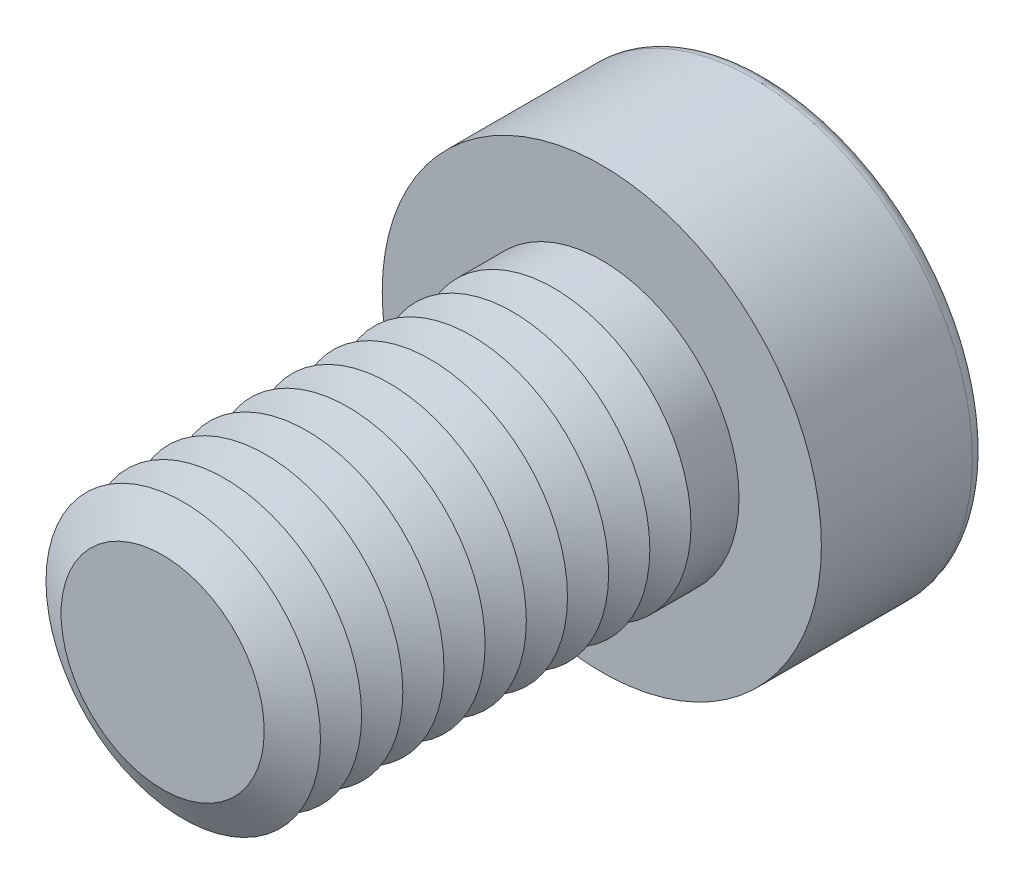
ISO-10303-21;
HEADER;
FILE_DESCRIPTION(('STEP AP214'),'2;1');
FILE_NAME('part.step','',(''),(''),'','','');
FILE_SCHEMA(('AUTOMOTIVE_DESIGN { 1 0 10303 214 1 1 1 1 }'));
ENDSEC;
DATA;
#1=APPLICATION_CONTEXT('core data for automotive mechanical design processes');
#2=APPLICATION_PROTOCOL_DEFINITION('international standard','automotive_design',2000,#1);
#3=PRODUCT_CONTEXT('',#1,'mechanical');
#4=PRODUCT('Part','Part','',(#3));
#5=PRODUCT_RELATED_PRODUCT_CATEGORY('part','',(#4));
#6=PRODUCT_DEFINITION_FORMATION('','',#4);
#7=PRODUCT_DEFINITION_CONTEXT('part definition',#1,'design');
#8=PRODUCT_DEFINITION('design','',#6,#7);
#9=PRODUCT_DEFINITION_SHAPE('','',#8);
#10=(LENGTH_UNIT() NAMED_UNIT(*) SI_UNIT(.MILLI.,.METRE.));
#11=(NAMED_UNIT(*) PLANE_ANGLE_UNIT() SI_UNIT($,.RADIAN.));
#12=(NAMED_UNIT(*) SI_UNIT($,.STERADIAN.) SOLID_ANGLE_UNIT());
#13=UNCERTAINTY_MEASURE_WITH_UNIT(LENGTH_MEASURE(1.E-05),#10,'distance_accuracy_value','');
#14=(GEOMETRIC_REPRESENTATION_CONTEXT(3) GLOBAL_UNCERTAINTY_ASSIGNED_CONTEXT((#13)) GLOBAL_UNIT_ASSIGNED_CONTEXT((#10,
#11,#12)) REPRESENTATION_CONTEXT('',''));
#15=CARTESIAN_POINT('',(0.,0.,0.));
#16=DIRECTION('',(0.,0.,1.));
#17=DIRECTION('',(1.,0.,0.));
#18=AXIS2_PLACEMENT_3D('',#15,#16,#17);
#19=CARTESIAN_POINT('',(0.,0.,10.75));
#20=DIRECTION('',(0.,0.,1.));
#21=DIRECTION('',(1.,0.,0.));
#22=AXIS2_PLACEMENT_3D('',#19,#20,#21);
#23=CONICAL_SURFACE('',#22,5.,1.0471975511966);
#24=CARTESIAN_POINT('',(0.,0.,10.));
#25=DIRECTION('',(0.,0.,1.));
#26=DIRECTION('',(1.,0.,0.));
#27=AXIS2_PLACEMENT_3D('',#24,#25,#26);
#28=CIRCLE('',#27,3.70096189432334);
#29=CARTESIAN_POINT('',(3.70096189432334,0.,10.));
#30=VERTEX_POINT('',#29);
#31=EDGE_CURVE('E313',#30,#30,#28,.T.);
#32=ORIENTED_EDGE('',*,*,#31,.T.);
#33=EDGE_LOOP('',(#32));
#34=FACE_BOUND('',#33,.T.);
#35=CARTESIAN_POINT('',(0.,0.,10.75));
#36=DIRECTION('',(0.,0.,1.));
#37=DIRECTION('',(1.,0.,0.));
#38=AXIS2_PLACEMENT_3D('',#35,#36,#37);
#39=CIRCLE('',#38,5.);
#40=CARTESIAN_POINT('',(5.,0.,10.75));
#41=VERTEX_POINT('',#40);
#42=EDGE_CURVE('E315',#41,#41,#39,.T.);
#43=ORIENTED_EDGE('',*,*,#42,.F.);
#44=EDGE_LOOP('',(#43));
#45=FACE_BOUND('',#44,.T.);
#46=ADVANCED_FACE('F39',(#34,#45),#23,.T.);
#47=CARTESIAN_POINT('',(0.,0.,10.));
#48=DIRECTION('',(0.,0.,-1.));
#49=DIRECTION('',(-1.,0.,0.));
#50=AXIS2_PLACEMENT_3D('',#47,#48,#49);
#51=CONICAL_SURFACE('',#50,3.70096189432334,1.0471975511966);
#52=CARTESIAN_POINT('',(0.,0.,9.25));
#53=DIRECTION('',(0.,0.,1.));
#54=DIRECTION('',(1.,0.,0.));
#55=AXIS2_PLACEMENT_3D('',#52,#53,#54);
#56=CIRCLE('',#55,5.);
#57=CARTESIAN_POINT('',(5.,0.,9.25));
#58=VERTEX_POINT('',#57);
#59=EDGE_CURVE('E323',#58,#58,#56,.T.);
#60=ORIENTED_EDGE('',*,*,#59,.T.);
#61=EDGE_LOOP('',(#60));
#62=FACE_BOUND('',#61,.T.);
#63=ORIENTED_EDGE('',*,*,#31,.F.);
#64=EDGE_LOOP('',(#63));
#65=FACE_BOUND('',#64,.T.);
#66=ADVANCED_FACE('F245',(#62,#65),#51,.T.);
#67=CARTESIAN_POINT('',(0.,0.,16.));
#68=DIRECTION('',(0.,0.,1.));
#69=DIRECTION('',(1.,0.,0.));
#70=AXIS2_PLACEMENT_3D('',#67,#68,#69);
#71=PLANE('',#70);
#72=CARTESIAN_POINT('',(0.,0.,16.));
#73=DIRECTION('',(0.,0.,1.));
#74=DIRECTION('',(1.,0.,0.));
#75=AXIS2_PLACEMENT_3D('',#72,#73,#74);
#76=CIRCLE('',#75,3.70096189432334);
#77=CARTESIAN_POINT('',(3.70096189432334,0.,16.));
#78=VERTEX_POINT('',#77);
#79=EDGE_CURVE('E174',#78,#78,#76,.T.);
#80=ORIENTED_EDGE('',*,*,#79,.T.);
#81=EDGE_LOOP('',(#80));
#82=FACE_BOUND('',#81,.T.);
#83=ADVANCED_FACE('F251',(#82),#71,.T.);
#84=CARTESIAN_POINT('',(0.,0.,16.));
#85=DIRECTION('',(0.,0.,-1.));
#86=DIRECTION('',(-1.,0.,0.));
#87=AXIS2_PLACEMENT_3D('',#84,#85,#86);
#88=CONICAL_SURFACE('',#87,3.70096189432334,1.0471975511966);
#89=CARTESIAN_POINT('',(0.,0.,15.25));
#90=DIRECTION('',(0.,0.,1.));
#91=DIRECTION('',(1.,0.,0.));
#92=AXIS2_PLACEMENT_3D('',#89,#90,#91);
#93=CIRCLE('',#92,5.);
#94=CARTESIAN_POINT('',(5.,0.,15.25));
#95=VERTEX_POINT('',#94);
#96=EDGE_CURVE('E291',#95,#95,#93,.T.);
#97=ORIENTED_EDGE('',*,*,#96,.T.);
#98=EDGE_LOOP('',(#97));
#99=FACE_BOUND('',#98,.T.);
#100=ORIENTED_EDGE('',*,*,#79,.F.);
#101=EDGE_LOOP('',(#100));
#102=FACE_BOUND('',#101,.T.);
#103=ADVANCED_FACE('F199',(#99,#102),#88,.T.);
#104=CARTESIAN_POINT('',(0.,0.,15.25));
#105=DIRECTION('',(0.,0.,1.));
#106=DIRECTION('',(1.,0.,0.));
#107=AXIS2_PLACEMENT_3D('',#104,#105,#106);
#108=CONICAL_SURFACE('',#107,5.,1.0471975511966);
#109=CARTESIAN_POINT('',(0.,0.,14.5));
#110=DIRECTION('',(0.,0.,1.));
#111=DIRECTION('',(1.,0.,0.));
#112=AXIS2_PLACEMENT_3D('',#109,#110,#111);
#113=CIRCLE('',#112,3.70096189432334);
#114=CARTESIAN_POINT('',(3.70096189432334,0.,14.5));
#115=VERTEX_POINT('',#114);
#116=EDGE_CURVE('E288',#115,#115,#113,.T.);
#117=ORIENTED_EDGE('',*,*,#116,.T.);
#118=EDGE_LOOP('',(#117));
#119=FACE_BOUND('',#118,.T.);
#120=ORIENTED_EDGE('',*,*,#96,.F.);
#121=EDGE_LOOP('',(#120));
#122=FACE_BOUND('',#121,.T.);
#123=ADVANCED_FACE('F277',(#119,#122),#108,.T.);
#124=CARTESIAN_POINT('',(0.,0.,14.5));
#125=DIRECTION('',(0.,0.,-1.));
#126=DIRECTION('',(-1.,0.,0.));
#127=AXIS2_PLACEMENT_3D('',#124,#125,#126);
#128=CONICAL_SURFACE('',#127,3.70096189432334,1.0471975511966);
#129=CARTESIAN_POINT('',(0.,0.,13.75));
#130=DIRECTION('',(0.,0.,1.));
#131=DIRECTION('',(1.,0.,0.));
#132=AXIS2_PLACEMENT_3D('',#129,#130,#131);
#133=CIRCLE('',#132,5.);
#134=CARTESIAN_POINT('',(5.,0.,13.75));
#135=VERTEX_POINT('',#134);
#136=EDGE_CURVE('E300',#135,#135,#133,.T.);
#137=ORIENTED_EDGE('',*,*,#136,.T.);
#138=EDGE_LOOP('',(#137));
#139=FACE_BOUND('',#138,.T.);
#140=ORIENTED_EDGE('',*,*,#116,.F.);
#141=EDGE_LOOP('',(#140));
#142=FACE_BOUND('',#141,.T.);
#143=ADVANCED_FACE('F274',(#139,#142),#128,.T.);
#144=CARTESIAN_POINT('',(0.,0.,13.75));
#145=DIRECTION('',(0.,0.,1.));
#146=DIRECTION('',(1.,0.,0.));
#147=AXIS2_PLACEMENT_3D('',#144,#145,#146);
#148=CONICAL_SURFACE('',#147,5.,1.0471975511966);
#149=CARTESIAN_POINT('',(0.,0.,13.));
#150=DIRECTION('',(0.,0.,1.));
#151=DIRECTION('',(1.,0.,0.));
#152=AXIS2_PLACEMENT_3D('',#149,#150,#151);
#153=CIRCLE('',#152,3.70096189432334);
#154=CARTESIAN_POINT('',(3.70096189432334,0.,13.));
#155=VERTEX_POINT('',#154);
#156=EDGE_CURVE('E293',#155,#155,#153,.T.);
#157=ORIENTED_EDGE('',*,*,#156,.T.);
#158=EDGE_LOOP('',(#157));
#159=FACE_BOUND('',#158,.T.);
#160=ORIENTED_EDGE('',*,*,#136,.F.);
#161=EDGE_LOOP('',(#160));
#162=FACE_BOUND('',#161,.T.);
#163=ADVANCED_FACE('F270',(#159,#162),#148,.T.);
#164=CARTESIAN_POINT('',(0.,0.,13.));
#165=DIRECTION('',(0.,0.,-1.));
#166=DIRECTION('',(-1.,0.,0.));
#167=AXIS2_PLACEMENT_3D('',#164,#165,#166);
#168=CONICAL_SURFACE('',#167,3.70096189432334,1.0471975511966);
#169=CARTESIAN_POINT('',(0.,0.,12.25));
#170=DIRECTION('',(0.,0.,1.));
#171=DIRECTION('',(1.,0.,0.));
#172=AXIS2_PLACEMENT_3D('',#169,#170,#171);
#173=CIRCLE('',#172,5.);
#174=CARTESIAN_POINT('',(5.,0.,12.25));
#175=VERTEX_POINT('',#174);
#176=EDGE_CURVE('E309',#175,#175,#173,.T.);
#177=ORIENTED_EDGE('',*,*,#176,.T.);
#178=EDGE_LOOP('',(#177));
#179=FACE_BOUND('',#178,.T.);
#180=ORIENTED_EDGE('',*,*,#156,.F.);
#181=EDGE_LOOP('',(#180));
#182=FACE_BOUND('',#181,.T.);
#183=ADVANCED_FACE('F266',(#179,#182),#168,.T.);
#184=CARTESIAN_POINT('',(0.,0.,12.25));
#185=DIRECTION('',(0.,0.,1.));
#186=DIRECTION('',(1.,0.,0.));
#187=AXIS2_PLACEMENT_3D('',#184,#185,#186);
#188=CONICAL_SURFACE('',#187,5.,1.0471975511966);
#189=CARTESIAN_POINT('',(0.,0.,11.5));
#190=DIRECTION('',(0.,0.,1.));
#191=DIRECTION('',(1.,0.,0.));
#192=AXIS2_PLACEMENT_3D('',#189,#190,#191);
#193=CIRCLE('',#192,3.70096189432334);
#194=CARTESIAN_POINT('',(3.70096189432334,0.,11.5));
#195=VERTEX_POINT('',#194);
#196=EDGE_CURVE('E306',#195,#195,#193,.T.);
#197=ORIENTED_EDGE('',*,*,#196,.T.);
#198=EDGE_LOOP('',(#197));
#199=FACE_BOUND('',#198,.T.);
#200=ORIENTED_EDGE('',*,*,#176,.F.);
#201=EDGE_LOOP('',(#200));
#202=FACE_BOUND('',#201,.T.);
#203=ADVANCED_FACE('F262',(#199,#202),#188,.T.);
#204=CARTESIAN_POINT('',(0.,0.,11.5));
#205=DIRECTION('',(0.,0.,-1.));
#206=DIRECTION('',(-1.,0.,0.));
#207=AXIS2_PLACEMENT_3D('',#204,#205,#206);
#208=CONICAL_SURFACE('',#207,3.70096189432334,1.0471975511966);
#209=ORIENTED_EDGE('',*,*,#42,.T.);
#210=EDGE_LOOP('',(#209));
#211=FACE_BOUND('',#210,.T.);
#212=ORIENTED_EDGE('',*,*,#196,.F.);
#213=EDGE_LOOP('',(#212));
#214=FACE_BOUND('',#213,.T.);
#215=ADVANCED_FACE('F258',(#211,#214),#208,.T.);
#216=CARTESIAN_POINT('',(0.,0.,9.25));
#217=DIRECTION('',(0.,0.,1.));
#218=DIRECTION('',(1.,0.,0.));
#219=AXIS2_PLACEMENT_3D('',#216,#217,#218);
#220=CONICAL_SURFACE('',#219,5.,1.0471975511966);
#221=CARTESIAN_POINT('',(0.,0.,8.5));
#222=DIRECTION('',(0.,0.,1.));
#223=DIRECTION('',(1.,0.,0.));
#224=AXIS2_PLACEMENT_3D('',#221,#222,#223);
#225=CIRCLE('',#224,3.70096189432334);
#226=CARTESIAN_POINT('',(3.70096189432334,0.,8.5));
#227=VERTEX_POINT('',#226);
#228=EDGE_CURVE('E319',#227,#227,#225,.T.);
#229=ORIENTED_EDGE('',*,*,#228,.T.);
#230=EDGE_LOOP('',(#229));
#231=FACE_BOUND('',#230,.T.);
#232=ORIENTED_EDGE('',*,*,#59,.F.);
#233=EDGE_LOOP('',(#232));
#234=FACE_BOUND('',#233,.T.);
#235=ADVANCED_FACE('F261',(#231,#234),#220,.T.);
#236=CARTESIAN_POINT('',(0.,0.,8.5));
#237=DIRECTION('',(0.,0.,-1.));
#238=DIRECTION('',(-1.,0.,0.));
#239=AXIS2_PLACEMENT_3D('',#236,#237,#238);
#240=CONICAL_SURFACE('',#239,3.70096189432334,1.0471975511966);
#241=CARTESIAN_POINT('',(0.,0.,7.75));
#242=DIRECTION('',(0.,0.,1.));
#243=DIRECTION('',(1.,0.,0.));
#244=AXIS2_PLACEMENT_3D('',#241,#242,#243);
#245=CIRCLE('',#244,5.);
#246=CARTESIAN_POINT('',(5.,0.,7.75));
#247=VERTEX_POINT('',#246);
#248=EDGE_CURVE('E331',#247,#247,#245,.T.);
#249=ORIENTED_EDGE('',*,*,#248,.T.);
#250=EDGE_LOOP('',(#249));
#251=FACE_BOUND('',#250,.T.);
#252=ORIENTED_EDGE('',*,*,#228,.F.);
#253=EDGE_LOOP('',(#252));
#254=FACE_BOUND('',#253,.T.);
#255=ADVANCED_FACE('F401',(#251,#254),#240,.T.);
#256=CARTESIAN_POINT('',(0.,0.,7.75));
#257=DIRECTION('',(0.,0.,1.));
#258=DIRECTION('',(1.,0.,0.));
#259=AXIS2_PLACEMENT_3D('',#256,#257,#258);
#260=CONICAL_SURFACE('',#259,5.,1.0471975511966);
#261=CARTESIAN_POINT('',(0.,0.,7.));
#262=DIRECTION('',(0.,0.,1.));
#263=DIRECTION('',(1.,0.,0.));
#264=AXIS2_PLACEMENT_3D('',#261,#262,#263);
#265=CIRCLE('',#264,3.70096189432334);
#266=CARTESIAN_POINT('',(3.70096189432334,0.,7.));
#267=VERTEX_POINT('',#266);
#268=EDGE_CURVE('E327',#267,#267,#265,.T.);
#269=ORIENTED_EDGE('',*,*,#268,.T.);
#270=EDGE_LOOP('',(#269));
#271=FACE_BOUND('',#270,.T.);
#272=ORIENTED_EDGE('',*,*,#248,.F.);
#273=EDGE_LOOP('',(#272));
#274=FACE_BOUND('',#273,.T.);
#275=ADVANCED_FACE('F397',(#271,#274),#260,.T.);
#276=CARTESIAN_POINT('',(0.,0.,7.));
#277=DIRECTION('',(0.,0.,-1.));
#278=DIRECTION('',(-1.,0.,0.));
#279=AXIS2_PLACEMENT_3D('',#276,#277,#278);
#280=CONICAL_SURFACE('',#279,3.70096189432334,1.0471975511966);
#281=CARTESIAN_POINT('',(0.,0.,6.25));
#282=DIRECTION('',(0.,0.,1.));
#283=DIRECTION('',(1.,0.,0.));
#284=AXIS2_PLACEMENT_3D('',#281,#282,#283);
#285=CIRCLE('',#284,5.);
#286=CARTESIAN_POINT('',(5.,0.,6.25));
#287=VERTEX_POINT('',#286);
#288=EDGE_CURVE('E339',#287,#287,#285,.T.);
#289=ORIENTED_EDGE('',*,*,#288,.T.);
#290=EDGE_LOOP('',(#289));
#291=FACE_BOUND('',#290,.T.);
#292=ORIENTED_EDGE('',*,*,#268,.F.);
#293=EDGE_LOOP('',(#292));
#294=FACE_BOUND('',#293,.T.);
#295=ADVANCED_FACE('F393',(#291,#294),#280,.T.);
#296=CARTESIAN_POINT('',(0.,0.,6.25));
#297=DIRECTION('',(0.,0.,1.));
#298=DIRECTION('',(1.,0.,0.));
#299=AXIS2_PLACEMENT_3D('',#296,#297,#298);
#300=CONICAL_SURFACE('',#299,5.,1.0471975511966);
#301=CARTESIAN_POINT('',(0.,0.,5.5));
#302=DIRECTION('',(0.,0.,1.));
#303=DIRECTION('',(1.,0.,0.));
#304=AXIS2_PLACEMENT_3D('',#301,#302,#303);
#305=CIRCLE('',#304,3.70096189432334);
#306=CARTESIAN_POINT('',(3.70096189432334,0.,5.5));
#307=VERTEX_POINT('',#306);
#308=EDGE_CURVE('E335',#307,#307,#305,.T.);
#309=ORIENTED_EDGE('',*,*,#308,.T.);
#310=EDGE_LOOP('',(#309));
#311=FACE_BOUND('',#310,.T.);
#312=ORIENTED_EDGE('',*,*,#288,.F.);
#313=EDGE_LOOP('',(#312));
#314=FACE_BOUND('',#313,.T.);
#315=ADVANCED_FACE('F389',(#311,#314),#300,.T.);
#316=CARTESIAN_POINT('',(0.,0.,5.5));
#317=DIRECTION('',(0.,0.,-1.));
#318=DIRECTION('',(-1.,0.,0.));
#319=AXIS2_PLACEMENT_3D('',#316,#317,#318);
#320=CONICAL_SURFACE('',#319,3.70096189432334,1.0471975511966);
#321=CARTESIAN_POINT('',(0.,0.,4.75));
#322=DIRECTION('',(0.,0.,1.));
#323=DIRECTION('',(1.,0.,0.));
#324=AXIS2_PLACEMENT_3D('',#321,#322,#323);
#325=CIRCLE('',#324,5.);
#326=CARTESIAN_POINT('',(5.,0.,4.75));
#327=VERTEX_POINT('',#326);
#328=EDGE_CURVE('E347',#327,#327,#325,.T.);
#329=ORIENTED_EDGE('',*,*,#328,.T.);
#330=EDGE_LOOP('',(#329));
#331=FACE_BOUND('',#330,.T.);
#332=ORIENTED_EDGE('',*,*,#308,.F.);
#333=EDGE_LOOP('',(#332));
#334=FACE_BOUND('',#333,.T.);
#335=ADVANCED_FACE('F385',(#331,#334),#320,.T.);
#336=CARTESIAN_POINT('',(0.,0.,4.75));
#337=DIRECTION('',(0.,0.,1.));
#338=DIRECTION('',(1.,0.,0.));
#339=AXIS2_PLACEMENT_3D('',#336,#337,#338);
#340=CONICAL_SURFACE('',#339,5.,1.0471975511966);
#341=CARTESIAN_POINT('',(0.,0.,4.));
#342=DIRECTION('',(0.,0.,1.));
#343=DIRECTION('',(1.,0.,0.));
#344=AXIS2_PLACEMENT_3D('',#341,#342,#343);
#345=CIRCLE('',#344,3.70096189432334);
#346=CARTESIAN_POINT('',(3.70096189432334,0.,4.));
#347=VERTEX_POINT('',#346);
#348=EDGE_CURVE('E343',#347,#347,#345,.T.);
#349=ORIENTED_EDGE('',*,*,#348,.T.);
#350=EDGE_LOOP('',(#349));
#351=FACE_BOUND('',#350,.T.);
#352=ORIENTED_EDGE('',*,*,#328,.F.);
#353=EDGE_LOOP('',(#352));
#354=FACE_BOUND('',#353,.T.);
#355=ADVANCED_FACE('F380',(#351,#354),#340,.T.);
#356=CARTESIAN_POINT('',(0.,0.,4.));
#357=DIRECTION('',(0.,0.,-1.));
#358=DIRECTION('',(-1.,0.,0.));
#359=AXIS2_PLACEMENT_3D('',#356,#357,#358);
#360=CONICAL_SURFACE('',#359,3.70096189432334,1.0471975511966);
#361=CARTESIAN_POINT('',(0.,0.,3.25));
#362=DIRECTION('',(0.,0.,1.));
#363=DIRECTION('',(1.,0.,0.));
#364=AXIS2_PLACEMENT_3D('',#361,#362,#363);
#365=CIRCLE('',#364,5.);
#366=CARTESIAN_POINT('',(5.,0.,3.25));
#367=VERTEX_POINT('',#366);
#368=EDGE_CURVE('E359',#367,#367,#365,.T.);
#369=ORIENTED_EDGE('',*,*,#368,.T.);
#370=EDGE_LOOP('',(#369));
#371=FACE_BOUND('',#370,.T.);
#372=ORIENTED_EDGE('',*,*,#348,.F.);
#373=EDGE_LOOP('',(#372));
#374=FACE_BOUND('',#373,.T.);
#375=ADVANCED_FACE('F366',(#371,#374),#360,.T.);
#376=CARTESIAN_POINT('',(0.,0.,3.25));
#377=DIRECTION('',(0.,0.,1.));
#378=DIRECTION('',(1.,0.,0.));
#379=AXIS2_PLACEMENT_3D('',#376,#377,#378);
#380=CONICAL_SURFACE('',#379,5.,1.0471975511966);
#381=CARTESIAN_POINT('',(0.,0.,2.5));
#382=DIRECTION('',(0.,0.,1.));
#383=DIRECTION('',(1.,0.,0.));
#384=AXIS2_PLACEMENT_3D('',#381,#382,#383);
#385=CIRCLE('',#384,3.70096189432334);
#386=CARTESIAN_POINT('',(3.70096189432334,0.,2.5));
#387=VERTEX_POINT('',#386);
#388=EDGE_CURVE('E351',#387,#387,#385,.T.);
#389=ORIENTED_EDGE('',*,*,#388,.T.);
#390=EDGE_LOOP('',(#389));
#391=FACE_BOUND('',#390,.T.);
#392=ORIENTED_EDGE('',*,*,#368,.F.);
#393=EDGE_LOOP('',(#392));
#394=FACE_BOUND('',#393,.T.);
#395=ADVANCED_FACE('F369',(#391,#394),#380,.T.);
#396=CARTESIAN_POINT('',(0.,0.,2.5));
#397=DIRECTION('',(0.,0.,-1.));
#398=DIRECTION('',(-1.,0.,0.));
#399=AXIS2_PLACEMENT_3D('',#396,#397,#398);
#400=CONICAL_SURFACE('',#399,3.70096189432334,1.0471975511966);
#401=CARTESIAN_POINT('',(0.,0.,1.75));
#402=DIRECTION('',(0.,0.,1.));
#403=DIRECTION('',(1.,0.,0.));
#404=AXIS2_PLACEMENT_3D('',#401,#402,#403);
#405=CIRCLE('',#404,5.);
#406=CARTESIAN_POINT('',(5.,0.,1.75));
#407=VERTEX_POINT('',#406);
#408=EDGE_CURVE('E355',#407,#407,#405,.T.);
#409=ORIENTED_EDGE('',*,*,#408,.T.);
#410=EDGE_LOOP('',(#409));
#411=FACE_BOUND('',#410,.T.);
#412=ORIENTED_EDGE('',*,*,#388,.F.);
#413=EDGE_LOOP('',(#412));
#414=FACE_BOUND('',#413,.T.);
#415=ADVANCED_FACE('F371',(#411,#414),#400,.T.);
#416=CARTESIAN_POINT('',(0.,0.,-0.75));
#417=DIRECTION('',(0.,0.,-1.));
#418=DIRECTION('',(-1.,0.,0.));
#419=AXIS2_PLACEMENT_3D('',#416,#417,#418);
#420=CONICAL_SURFACE('',#419,3.5,1.0471975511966);
#421=CARTESIAN_POINT('',(0.,0.,1.27072594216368));
#422=VERTEX_POINT('',#421);
#423=VERTEX_LOOP('',#422);
#424=FACE_BOUND('',#423,.T.);
#425=CARTESIAN_POINT('',(0.,0.,-0.75));
#426=DIRECTION('',(0.,0.,-1.));
#427=DIRECTION('',(-1.,0.,0.));
#428=AXIS2_PLACEMENT_3D('',#425,#426,#427);
#429=CIRCLE('',#428,3.5);
#430=CARTESIAN_POINT('',(-3.03108891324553,1.75,-0.75));
#431=VERTEX_POINT('',#430);
#432=CARTESIAN_POINT('',(0.,3.5,-0.75));
#433=VERTEX_POINT('',#432);
#434=EDGE_CURVE('E149',#431,#433,#429,.T.);
#435=ORIENTED_EDGE('',*,*,#434,.T.);
#436=CARTESIAN_POINT('',(0.,0.,-0.75));
#437=DIRECTION('',(0.,0.,-1.));
#438=DIRECTION('',(-1.,0.,0.));
#439=AXIS2_PLACEMENT_3D('',#436,#437,#438);
#440=CIRCLE('',#439,3.5);
#441=CARTESIAN_POINT('',(3.03108891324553,1.75,-0.75));
#442=VERTEX_POINT('',#441);
#443=EDGE_CURVE('E54',#433,#442,#440,.T.);
#444=ORIENTED_EDGE('',*,*,#443,.T.);
#445=CARTESIAN_POINT('',(3.03108891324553,-1.75,-0.75));
#446=VERTEX_POINT('',#445);
#447=EDGE_CURVE('E818',#442,#446,#440,.T.);
#448=ORIENTED_EDGE('',*,*,#447,.T.);
#449=CARTESIAN_POINT('',(0.,-3.5,-0.75));
#450=VERTEX_POINT('',#449);
#451=EDGE_CURVE('E816',#446,#450,#440,.T.);
#452=ORIENTED_EDGE('',*,*,#451,.T.);
#453=CARTESIAN_POINT('',(-3.03108891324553,-1.75,-0.75));
#454=VERTEX_POINT('',#453);
#455=EDGE_CURVE('E812',#450,#454,#440,.T.);
#456=ORIENTED_EDGE('',*,*,#455,.T.);
#457=EDGE_CURVE('E810',#454,#431,#440,.T.);
#458=ORIENTED_EDGE('',*,*,#457,.T.);
#459=EDGE_LOOP('',(#435,#444,#448,#452,#456,#458));
#460=FACE_BOUND('',#459,.T.);
#461=ADVANCED_FACE('F201',(#424,#460),#420,.F.);
#462=CARTESIAN_POINT('',(0.,0.,-0.75));
#463=DIRECTION('',(0.,0.,-1.));
#464=DIRECTION('',(-1.,0.,0.));
#465=AXIS2_PLACEMENT_3D('',#462,#463,#464);
#466=PLANE('',#465);
#467=ORIENTED_EDGE('',*,*,#443,.F.);
#468=DIRECTION('',(1.,0.,0.));
#469=VECTOR('',#468,1.);
#470=CARTESIAN_POINT('',(-2.02072594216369,3.5,-0.75));
#471=LINE('',#470,#469);
#472=CARTESIAN_POINT('',(2.02072594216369,3.5,-0.75));
#473=VERTEX_POINT('',#472);
#474=EDGE_CURVE('E861',#433,#473,#471,.T.);
#475=ORIENTED_EDGE('',*,*,#474,.T.);
#476=DIRECTION('',(0.5,-0.866025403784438,0.));
#477=VECTOR('',#476,1.);
#478=CARTESIAN_POINT('',(2.02072594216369,3.5,-0.75));
#479=LINE('',#478,#477);
#480=EDGE_CURVE('E155',#473,#442,#479,.T.);
#481=ORIENTED_EDGE('',*,*,#480,.T.);
#482=EDGE_LOOP('',(#467,#475,#481));
#483=FACE_BOUND('',#482,.T.);
#484=ADVANCED_FACE('F454',(#483),#466,.T.);
#485=ORIENTED_EDGE('',*,*,#447,.F.);
#486=CARTESIAN_POINT('',(4.04145188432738,0.,-0.75));
#487=VERTEX_POINT('',#486);
#488=EDGE_CURVE('E855',#442,#487,#479,.T.);
#489=ORIENTED_EDGE('',*,*,#488,.T.);
#490=DIRECTION('',(-0.5,-0.866025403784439,0.));
#491=VECTOR('',#490,1.);
#492=CARTESIAN_POINT('',(4.04145188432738,0.,-0.75));
#493=LINE('',#492,#491);
#494=EDGE_CURVE('E830',#487,#446,#493,.T.);
#495=ORIENTED_EDGE('',*,*,#494,.T.);
#496=EDGE_LOOP('',(#485,#489,#495));
#497=FACE_BOUND('',#496,.T.);
#498=ADVANCED_FACE('F464',(#497),#466,.T.);
#499=ORIENTED_EDGE('',*,*,#451,.F.);
#500=CARTESIAN_POINT('',(2.02072594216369,-3.5,-0.75));
#501=VERTEX_POINT('',#500);
#502=EDGE_CURVE('E832',#446,#501,#493,.T.);
#503=ORIENTED_EDGE('',*,*,#502,.T.);
#504=DIRECTION('',(-1.,0.,0.));
#505=VECTOR('',#504,1.);
#506=CARTESIAN_POINT('',(2.02072594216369,-3.5,-0.75));
#507=LINE('',#506,#505);
#508=EDGE_CURVE('E786',#501,#450,#507,.T.);
#509=ORIENTED_EDGE('',*,*,#508,.T.);
#510=EDGE_LOOP('',(#499,#503,#509));
#511=FACE_BOUND('',#510,.T.);
#512=ADVANCED_FACE('F474',(#511),#466,.T.);
#513=ORIENTED_EDGE('',*,*,#455,.F.);
#514=CARTESIAN_POINT('',(-2.02072594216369,-3.5,-0.75));
#515=VERTEX_POINT('',#514);
#516=EDGE_CURVE('E826',#450,#515,#507,.T.);
#517=ORIENTED_EDGE('',*,*,#516,.T.);
#518=DIRECTION('',(-0.5,0.866025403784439,0.));
#519=VECTOR('',#518,1.);
#520=CARTESIAN_POINT('',(-2.02072594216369,-3.5,-0.75));
#521=LINE('',#520,#519);
#522=EDGE_CURVE('E828',#515,#454,#521,.T.);
#523=ORIENTED_EDGE('',*,*,#522,.T.);
#524=EDGE_LOOP('',(#513,#517,#523));
#525=FACE_BOUND('',#524,.T.);
#526=ADVANCED_FACE('F482',(#525),#466,.T.);
#527=ORIENTED_EDGE('',*,*,#457,.F.);
#528=CARTESIAN_POINT('',(-4.04145188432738,0.,-0.75));
#529=VERTEX_POINT('',#528);
#530=EDGE_CURVE('E833',#454,#529,#521,.T.);
#531=ORIENTED_EDGE('',*,*,#530,.T.);
#532=DIRECTION('',(0.5,0.866025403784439,0.));
#533=VECTOR('',#532,1.);
#534=CARTESIAN_POINT('',(-4.04145188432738,0.,-0.75));
#535=LINE('',#534,#533);
#536=EDGE_CURVE('E158',#529,#431,#535,.T.);
#537=ORIENTED_EDGE('',*,*,#536,.T.);
#538=EDGE_LOOP('',(#527,#531,#537));
#539=FACE_BOUND('',#538,.T.);
#540=ADVANCED_FACE('F231',(#539),#466,.T.);
#541=ORIENTED_EDGE('',*,*,#434,.F.);
#542=CARTESIAN_POINT('',(-2.02072594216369,3.5,-0.75));
#543=VERTEX_POINT('',#542);
#544=EDGE_CURVE('E839',#431,#543,#535,.T.);
#545=ORIENTED_EDGE('',*,*,#544,.T.);
#546=EDGE_CURVE('E857',#543,#433,#471,.T.);
#547=ORIENTED_EDGE('',*,*,#546,.T.);
#548=EDGE_LOOP('',(#541,#545,#547));
#549=FACE_BOUND('',#548,.T.);
#550=ADVANCED_FACE('F466',(#549),#466,.T.);
#551=CARTESIAN_POINT('',(-2.02072594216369,3.5,-0.75));
#552=DIRECTION('',(0.,1.,0.));
#553=DIRECTION('',(0.,0.,1.));
#554=AXIS2_PLACEMENT_3D('',#551,#552,#553);
#555=PLANE('',#554);
#556=DIRECTION('',(0.,0.,-1.));
#557=VECTOR('',#556,1.);
#558=CARTESIAN_POINT('',(-2.02072594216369,3.5,-0.75));
#559=LINE('',#558,#557);
#560=CARTESIAN_POINT('',(-2.02072594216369,3.5,-6.));
#561=VERTEX_POINT('',#560);
#562=EDGE_CURVE('E147',#543,#561,#559,.T.);
#563=ORIENTED_EDGE('',*,*,#562,.T.);
#564=CARTESIAN_POINT('',(-5.27521327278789,3.5,-6.613404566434));
#565=CARTESIAN_POINT('',(-5.11717138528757,3.5,-6.57812703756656));
#566=CARTESIAN_POINT('',(-4.95902873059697,3.5,-6.5432936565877));
#567=CARTESIAN_POINT('',(-4.64249233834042,3.5,-6.47475322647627));
#568=CARTESIAN_POINT('',(-4.48409858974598,3.5,-6.44104622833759));
#569=CARTESIAN_POINT('',(-4.16686075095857,3.5,-6.37496567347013));
#570=CARTESIAN_POINT('',(-4.00801636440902,3.5,-6.34259353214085));
#571=CARTESIAN_POINT('',(-3.68999232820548,3.5,-6.27954992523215));
#572=CARTESIAN_POINT('',(-3.53081268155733,3.5,-6.24887844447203));
#573=CARTESIAN_POINT('',(-3.05545711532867,3.5,-6.16049717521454));
#574=CARTESIAN_POINT('',(-2.73870333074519,3.5,-6.10583257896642));
#575=CARTESIAN_POINT('',(-2.10326379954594,3.5,-6.00899390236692));
#576=CARTESIAN_POINT('',(-1.78457845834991,3.5,-5.9668172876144));
#577=CARTESIAN_POINT('',(-1.30331397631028,3.5,-5.91703310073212));
#578=CARTESIAN_POINT('',(-1.14143900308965,3.5,-5.90264327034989));
#579=CARTESIAN_POINT('',(-0.81729610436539,3.5,-5.87924021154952));
#580=CARTESIAN_POINT('',(-0.655028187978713,3.5,-5.87022685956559));
#581=CARTESIAN_POINT('',(-0.330337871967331,3.5,-5.8581019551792));
#582=CARTESIAN_POINT('',(-0.167915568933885,3.5,-5.85498786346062));
#583=CARTESIAN_POINT('',(0.156931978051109,3.5,-5.85485125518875));
#584=CARTESIAN_POINT('',(0.319357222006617,3.5,-5.8578287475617));
#585=CARTESIAN_POINT('',(0.644649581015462,3.5,-5.86971076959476));
#586=CARTESIAN_POINT('',(0.807515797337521,3.5,-5.87863941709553));
#587=CARTESIAN_POINT('',(1.13286152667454,3.5,-5.90192432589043));
#588=CARTESIAN_POINT('',(1.29534101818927,3.5,-5.91628088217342));
#589=CARTESIAN_POINT('',(1.61990955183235,3.5,-5.94971371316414));
#590=CARTESIAN_POINT('',(1.78199828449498,3.5,-5.96879294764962));
#591=CARTESIAN_POINT('',(2.105656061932,3.5,-6.01089893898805));
#592=CARTESIAN_POINT('',(2.26722510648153,3.5,-6.03392569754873));
#593=CARTESIAN_POINT('',(2.59408673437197,3.5,-6.08385328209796));
#594=CARTESIAN_POINT('',(2.75936612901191,3.5,-6.11083971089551));
#595=CARTESIAN_POINT('',(3.08945524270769,3.5,-6.16755337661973));
#596=CARTESIAN_POINT('',(3.25426494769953,3.5,-6.19728069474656));
#597=CARTESIAN_POINT('',(3.74811783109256,3.5,-6.28973245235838));
#598=CARTESIAN_POINT('',(4.07654810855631,3.5,-6.35572082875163));
#599=CARTESIAN_POINT('',(4.73230999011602,3.5,-6.49329874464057));
#600=CARTESIAN_POINT('',(5.05964125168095,3.5,-6.56488988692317));
#601=CARTESIAN_POINT('',(5.71347161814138,3.5,-6.71179760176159));
#602=CARTESIAN_POINT('',(6.03997070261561,3.5,-6.78711426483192));
#603=CARTESIAN_POINT('',(6.68838444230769,3.5,-6.93936666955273));
#604=CARTESIAN_POINT('',(7.01030641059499,3.5,-7.01627142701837));
#605=CARTESIAN_POINT('',(7.65372712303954,3.5,-7.17185944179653));
#606=CARTESIAN_POINT('',(7.97522585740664,3.5,-7.25054273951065));
#607=CARTESIAN_POINT('',(8.61745492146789,3.5,-7.409094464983));
#608=CARTESIAN_POINT('',(8.93818569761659,3.5,-7.48896108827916));
#609=CARTESIAN_POINT('',(9.57938765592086,3.5,-7.64968154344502));
#610=CARTESIAN_POINT('',(9.89985884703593,3.5,-7.73053533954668));
#611=CARTESIAN_POINT('',(10.2202418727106,3.5,-7.81173318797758));
#612=B_SPLINE_CURVE_WITH_KNOTS('',3,(#564,#565,#566,#567,#568,#569,#570,#571,#572,#573,#574,
#575,#576,#577,#578,#579,#580,#581,#582,#583,#584,#585,#586,#587,#588,#589,#590,#591,#592,#593,
#594,#595,#596,#597,#598,#599,#600,#601,#602,#603,#604,#605,#606,#607,#608,#609,#610,#611),
.UNSPECIFIED.,.F.,.F.,(4,2,2,2,2,2,2,2,2,2,2,2,2,2,2,2,2,2,2,2,2,2,2,4),(0.,0.485795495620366,
0.971612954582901,1.45793295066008,1.94424860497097,2.90841266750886,3.87238092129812,
4.35984584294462,4.84729956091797,5.33454340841,5.82178796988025,6.31101925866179,
6.80027713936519,7.28984242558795,7.77940792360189,8.28178329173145,8.78417354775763,
9.78906542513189,10.7942458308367,11.7994506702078,12.7923858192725,13.7853435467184,
14.7769174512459,15.7684555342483),.UNSPECIFIED.);
#613=CARTESIAN_POINT('',(2.02072594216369,3.5,-6.));
#614=VERTEX_POINT('',#613);
#615=EDGE_CURVE('E124',#561,#614,#612,.T.);
#616=ORIENTED_EDGE('',*,*,#615,.T.);
#617=DIRECTION('',(0.,0.,-1.));
#618=VECTOR('',#617,1.);
#619=CARTESIAN_POINT('',(2.02072594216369,3.5,-0.75));
#620=LINE('',#619,#618);
#621=EDGE_CURVE('E143',#473,#614,#620,.T.);
#622=ORIENTED_EDGE('',*,*,#621,.F.);
#623=ORIENTED_EDGE('',*,*,#474,.F.);
#624=ORIENTED_EDGE('',*,*,#546,.F.);
#625=EDGE_LOOP('',(#563,#616,#622,#623,#624));
#626=FACE_BOUND('',#625,.T.);
#627=ADVANCED_FACE('F141',(#626),#555,.F.);
#628=CARTESIAN_POINT('',(2.02072594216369,3.5,-0.75));
#629=DIRECTION('',(0.866025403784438,0.5,0.));
#630=DIRECTION('',(-0.5,0.866025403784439,0.));
#631=AXIS2_PLACEMENT_3D('',#628,#629,#630);
#632=PLANE('',#631);
#633=ORIENTED_EDGE('',*,*,#621,.T.);
#634=CARTESIAN_POINT('',(2.02061047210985,3.5002,-6.00003094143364));
#635=CARTESIAN_POINT('',(2.10453570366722,3.35483723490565,-5.97753281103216));
#636=CARTESIAN_POINT('',(2.18861311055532,3.20921089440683,-5.95710815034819));
#637=CARTESIAN_POINT('',(2.35706487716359,2.91744387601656,-5.92122385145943));
#638=CARTESIAN_POINT('',(2.44143934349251,2.77130301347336,-5.90576623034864));
#639=CARTESIAN_POINT('',(2.6099736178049,2.47939308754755,-5.88071849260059));
#640=CARTESIAN_POINT('',(2.69413228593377,2.33362599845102,-5.87109850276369));
#641=CARTESIAN_POINT('',(2.86255695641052,2.04190591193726,-5.85819907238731));
#642=CARTESIAN_POINT('',(2.94682293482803,1.89595295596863,-5.85491840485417));
#643=CARTESIAN_POINT('',(3.11535489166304,1.60404704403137,-5.85491840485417));
#644=CARTESIAN_POINT('',(3.19962087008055,1.45809408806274,-5.85819907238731));
#645=CARTESIAN_POINT('',(3.3680455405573,1.16637400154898,-5.87109850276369));
#646=CARTESIAN_POINT('',(3.45220420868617,1.02060691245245,-5.88071849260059));
#647=CARTESIAN_POINT('',(3.62073848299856,0.728696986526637,-5.90576623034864));
#648=CARTESIAN_POINT('',(3.70511294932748,0.582556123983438,-5.92122385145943));
#649=CARTESIAN_POINT('',(3.87356471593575,0.290789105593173,-5.95710815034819));
#650=CARTESIAN_POINT('',(3.95764212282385,0.145162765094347,-5.97753281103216));
#651=CARTESIAN_POINT('',(4.04156735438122,-0.000199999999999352,-6.00003094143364));
#652=B_SPLINE_CURVE_WITH_KNOTS('',3,(#634,#635,#636,#637,#638,#639,#640,#641,#642,#643,#644,
#645,#646,#647,#648,#649,#650,#651),.UNSPECIFIED.,.F.,.F.,(4,2,2,2,2,2,2,2,4),(0.,
0.508081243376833,1.01636855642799,1.52203235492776,2.02759827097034,2.53316418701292,
3.03882798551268,3.54711529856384,4.05519654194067),.UNSPECIFIED.);
#653=CARTESIAN_POINT('',(4.04145188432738,0.,-6.));
#654=VERTEX_POINT('',#653);
#655=EDGE_CURVE('E11',#614,#654,#652,.T.);
#656=ORIENTED_EDGE('',*,*,#655,.T.);
#657=DIRECTION('',(0.,0.,-1.));
#658=VECTOR('',#657,1.);
#659=CARTESIAN_POINT('',(4.04145188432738,0.,-0.75));
#660=LINE('',#659,#658);
#661=EDGE_CURVE('E157',#487,#654,#660,.T.);
#662=ORIENTED_EDGE('',*,*,#661,.F.);
#663=ORIENTED_EDGE('',*,*,#488,.F.);
#664=ORIENTED_EDGE('',*,*,#480,.F.);
#665=EDGE_LOOP('',(#633,#656,#662,#663,#664));
#666=FACE_BOUND('',#665,.T.);
#667=ADVANCED_FACE('F152',(#666),#632,.F.);
#668=CARTESIAN_POINT('',(4.04145188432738,0.,-0.75));
#669=DIRECTION('',(0.866025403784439,-0.5,0.));
#670=DIRECTION('',(0.5,0.866025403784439,0.));
#671=AXIS2_PLACEMENT_3D('',#668,#669,#670);
#672=PLANE('',#671);
#673=ORIENTED_EDGE('',*,*,#661,.T.);
#674=CARTESIAN_POINT('',(4.04156735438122,0.000200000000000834,-6.00003094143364));
#675=CARTESIAN_POINT('',(3.95764212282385,-0.145162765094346,-5.97753281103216));
#676=CARTESIAN_POINT('',(3.87356471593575,-0.290789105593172,-5.95710815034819));
#677=CARTESIAN_POINT('',(3.70511294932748,-0.582556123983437,-5.92122385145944));
#678=CARTESIAN_POINT('',(3.62073848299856,-0.728696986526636,-5.90576623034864));
#679=CARTESIAN_POINT('',(3.45220420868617,-1.02060691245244,-5.88071849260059));
#680=CARTESIAN_POINT('',(3.3680455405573,-1.16637400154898,-5.87109850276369));
#681=CARTESIAN_POINT('',(3.19962087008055,-1.45809408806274,-5.85819907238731));
#682=CARTESIAN_POINT('',(3.11535489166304,-1.60404704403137,-5.85491840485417));
#683=CARTESIAN_POINT('',(2.94682293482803,-1.89595295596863,-5.85491840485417));
#684=CARTESIAN_POINT('',(2.86255695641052,-2.04190591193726,-5.85819907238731));
#685=CARTESIAN_POINT('',(2.69413228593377,-2.33362599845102,-5.87109850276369));
#686=CARTESIAN_POINT('',(2.6099736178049,-2.47939308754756,-5.88071849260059));
#687=CARTESIAN_POINT('',(2.44143934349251,-2.77130301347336,-5.90576623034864));
#688=CARTESIAN_POINT('',(2.35706487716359,-2.91744387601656,-5.92122385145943));
#689=CARTESIAN_POINT('',(2.18861311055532,-3.20921089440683,-5.95710815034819));
#690=CARTESIAN_POINT('',(2.10453570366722,-3.35483723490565,-5.97753281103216));
#691=CARTESIAN_POINT('',(2.02061047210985,-3.5002,-6.00003094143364));
#692=B_SPLINE_CURVE_WITH_KNOTS('',3,(#674,#675,#676,#677,#678,#679,#680,#681,#682,#683,#684,
#685,#686,#687,#688,#689,#690,#691),.UNSPECIFIED.,.F.,.F.,(4,2,2,2,2,2,2,2,4),(0.,
0.508081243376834,1.016368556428,1.52203235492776,2.02759827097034,2.53316418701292,
3.03882798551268,3.54711529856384,4.05519654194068),.UNSPECIFIED.);
#693=CARTESIAN_POINT('',(2.02072594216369,-3.5,-6.));
#694=VERTEX_POINT('',#693);
#695=EDGE_CURVE('E173',#654,#694,#692,.T.);
#696=ORIENTED_EDGE('',*,*,#695,.T.);
#697=DIRECTION('',(0.,0.,-1.));
#698=VECTOR('',#697,1.);
#699=CARTESIAN_POINT('',(2.02072594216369,-3.5,-0.75));
#700=LINE('',#699,#698);
#701=EDGE_CURVE('E781',#501,#694,#700,.T.);
#702=ORIENTED_EDGE('',*,*,#701,.F.);
#703=ORIENTED_EDGE('',*,*,#502,.F.);
#704=ORIENTED_EDGE('',*,*,#494,.F.);
#705=EDGE_LOOP('',(#673,#696,#702,#703,#704));
#706=FACE_BOUND('',#705,.T.);
#707=ADVANCED_FACE('F191',(#706),#672,.F.);
#708=CARTESIAN_POINT('',(2.02072594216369,-3.5,-0.75));
#709=DIRECTION('',(0.,-1.,0.));
#710=DIRECTION('',(1.,0.,0.));
#711=AXIS2_PLACEMENT_3D('',#708,#709,#710);
#712=PLANE('',#711);
#713=ORIENTED_EDGE('',*,*,#701,.T.);
#714=CARTESIAN_POINT('',(-5.27521327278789,-3.5,-6.613404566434));
#715=CARTESIAN_POINT('',(-5.11717138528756,-3.5,-6.57812703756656));
#716=CARTESIAN_POINT('',(-4.95902873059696,-3.5,-6.5432936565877));
#717=CARTESIAN_POINT('',(-4.64249233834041,-3.5,-6.47475322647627));
#718=CARTESIAN_POINT('',(-4.48409858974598,-3.5,-6.44104622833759));
#719=CARTESIAN_POINT('',(-4.16686075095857,-3.5,-6.37496567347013));
#720=CARTESIAN_POINT('',(-4.00801636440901,-3.5,-6.34259353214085));
#721=CARTESIAN_POINT('',(-3.68999232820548,-3.5,-6.27954992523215));
#722=CARTESIAN_POINT('',(-3.53081268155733,-3.5,-6.24887844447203));
#723=CARTESIAN_POINT('',(-3.05545711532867,-3.5,-6.16049717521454));
#724=CARTESIAN_POINT('',(-2.73870333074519,-3.5,-6.10583257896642));
#725=CARTESIAN_POINT('',(-2.10326379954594,-3.5,-6.00899390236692));
#726=CARTESIAN_POINT('',(-1.78457845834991,-3.5,-5.9668172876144));
#727=CARTESIAN_POINT('',(-1.30331397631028,-3.5,-5.91703310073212));
#728=CARTESIAN_POINT('',(-1.14143900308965,-3.5,-5.90264327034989));
#729=CARTESIAN_POINT('',(-0.81729610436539,-3.5,-5.87924021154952));
#730=CARTESIAN_POINT('',(-0.655028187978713,-3.5,-5.87022685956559));
#731=CARTESIAN_POINT('',(-0.330337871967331,-3.5,-5.8581019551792));
#732=CARTESIAN_POINT('',(-0.167915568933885,-3.5,-5.85498786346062));
#733=CARTESIAN_POINT('',(0.156931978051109,-3.5,-5.85485125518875));
#734=CARTESIAN_POINT('',(0.319357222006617,-3.5,-5.8578287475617));
#735=CARTESIAN_POINT('',(0.644649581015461,-3.5,-5.86971076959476));
#736=CARTESIAN_POINT('',(0.80751579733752,-3.5,-5.87863941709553));
#737=CARTESIAN_POINT('',(1.13286152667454,-3.5,-5.90192432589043));
#738=CARTESIAN_POINT('',(1.29534101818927,-3.5,-5.91628088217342));
#739=CARTESIAN_POINT('',(1.61990955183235,-3.5,-5.94971371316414));
#740=CARTESIAN_POINT('',(1.78199828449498,-3.5,-5.96879294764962));
#741=CARTESIAN_POINT('',(2.10565606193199,-3.5,-6.01089893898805));
#742=CARTESIAN_POINT('',(2.26722510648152,-3.5,-6.03392569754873));
#743=CARTESIAN_POINT('',(2.59408673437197,-3.5,-6.08385328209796));
#744=CARTESIAN_POINT('',(2.75936612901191,-3.5,-6.11083971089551));
#745=CARTESIAN_POINT('',(3.08945524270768,-3.5,-6.16755337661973));
#746=CARTESIAN_POINT('',(3.25426494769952,-3.5,-6.19728069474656));
#747=CARTESIAN_POINT('',(3.74811783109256,-3.5,-6.28973245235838));
#748=CARTESIAN_POINT('',(4.0765481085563,-3.5,-6.35572082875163));
#749=CARTESIAN_POINT('',(4.73230999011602,-3.5,-6.49329874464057));
#750=CARTESIAN_POINT('',(5.05964125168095,-3.5,-6.56488988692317));
#751=CARTESIAN_POINT('',(5.71347161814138,-3.5,-6.71179760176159));
#752=CARTESIAN_POINT('',(6.03997070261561,-3.5,-6.78711426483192));
#753=CARTESIAN_POINT('',(6.68838444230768,-3.5,-6.93936666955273));
#754=CARTESIAN_POINT('',(7.01030641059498,-3.5,-7.01627142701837));
#755=CARTESIAN_POINT('',(7.65372712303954,-3.5,-7.17185944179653));
#756=CARTESIAN_POINT('',(7.97522585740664,-3.5,-7.25054273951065));
#757=CARTESIAN_POINT('',(8.61745492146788,-3.5,-7.409094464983));
#758=CARTESIAN_POINT('',(8.93818569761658,-3.5,-7.48896108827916));
#759=CARTESIAN_POINT('',(9.57938765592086,-3.5,-7.64968154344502));
#760=CARTESIAN_POINT('',(9.89985884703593,-3.5,-7.73053533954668));
#761=CARTESIAN_POINT('',(10.2202418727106,-3.5,-7.81173318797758));
#762=B_SPLINE_CURVE_WITH_KNOTS('',3,(#714,#715,#716,#717,#718,#719,#720,#721,#722,#723,#724,
#725,#726,#727,#728,#729,#730,#731,#732,#733,#734,#735,#736,#737,#738,#739,#740,#741,#742,#743,
#744,#745,#746,#747,#748,#749,#750,#751,#752,#753,#754,#755,#756,#757,#758,#759,#760,#761),
.UNSPECIFIED.,.F.,.F.,(4,2,2,2,2,2,2,2,2,2,2,2,2,2,2,2,2,2,2,2,2,2,2,4),(0.,0.485795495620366,
0.971612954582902,1.45793295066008,1.94424860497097,2.90841266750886,3.87238092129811,
4.35984584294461,4.84729956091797,5.33454340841,5.82178796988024,6.31101925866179,
6.80027713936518,7.28984242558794,7.77940792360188,8.28178329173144,8.78417354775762,
9.78906542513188,10.7942458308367,11.7994506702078,12.7923858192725,13.7853435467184,
14.7769174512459,15.7684555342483),.UNSPECIFIED.);
#763=CARTESIAN_POINT('',(-2.02072594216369,-3.5,-6.));
#764=VERTEX_POINT('',#763);
#765=EDGE_CURVE('E184',#694,#764,#762,.F.);
#766=ORIENTED_EDGE('',*,*,#765,.T.);
#767=DIRECTION('',(0.,0.,-1.));
#768=VECTOR('',#767,1.);
#769=CARTESIAN_POINT('',(-2.02072594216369,-3.5,-0.75));
#770=LINE('',#769,#768);
#771=EDGE_CURVE('E788',#515,#764,#770,.T.);
#772=ORIENTED_EDGE('',*,*,#771,.F.);
#773=ORIENTED_EDGE('',*,*,#516,.F.);
#774=ORIENTED_EDGE('',*,*,#508,.F.);
#775=EDGE_LOOP('',(#713,#766,#772,#773,#774));
#776=FACE_BOUND('',#775,.T.);
#777=ADVANCED_FACE('F234',(#776),#712,.F.);
#778=CARTESIAN_POINT('',(-2.02072594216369,-3.5,-0.75));
#779=DIRECTION('',(-0.866025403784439,-0.5,0.));
#780=DIRECTION('',(0.5,-0.866025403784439,0.));
#781=AXIS2_PLACEMENT_3D('',#778,#779,#780);
#782=PLANE('',#781);
#783=ORIENTED_EDGE('',*,*,#771,.T.);
#784=CARTESIAN_POINT('',(-2.02061047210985,-3.5002,-6.00003094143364));
#785=CARTESIAN_POINT('',(-2.10453570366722,-3.35483723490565,-5.97753281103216));
#786=CARTESIAN_POINT('',(-2.18861311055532,-3.20921089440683,-5.95710815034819));
#787=CARTESIAN_POINT('',(-2.35706487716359,-2.91744387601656,-5.92122385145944));
#788=CARTESIAN_POINT('',(-2.44143934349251,-2.77130301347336,-5.90576623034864));
#789=CARTESIAN_POINT('',(-2.6099736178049,-2.47939308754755,-5.88071849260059));
#790=CARTESIAN_POINT('',(-2.69413228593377,-2.33362599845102,-5.87109850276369));
#791=CARTESIAN_POINT('',(-2.86255695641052,-2.04190591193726,-5.85819907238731));
#792=CARTESIAN_POINT('',(-2.94682293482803,-1.89595295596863,-5.85491840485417));
#793=CARTESIAN_POINT('',(-3.11535489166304,-1.60404704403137,-5.85491840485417));
#794=CARTESIAN_POINT('',(-3.19962087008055,-1.45809408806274,-5.85819907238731));
#795=CARTESIAN_POINT('',(-3.3680455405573,-1.16637400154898,-5.87109850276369));
#796=CARTESIAN_POINT('',(-3.45220420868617,-1.02060691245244,-5.88071849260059));
#797=CARTESIAN_POINT('',(-3.62073848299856,-0.728696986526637,-5.90576623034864));
#798=CARTESIAN_POINT('',(-3.70511294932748,-0.582556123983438,-5.92122385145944));
#799=CARTESIAN_POINT('',(-3.87356471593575,-0.290789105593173,-5.95710815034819));
#800=CARTESIAN_POINT('',(-3.95764212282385,-0.145162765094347,-5.97753281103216));
#801=CARTESIAN_POINT('',(-4.04156735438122,0.000199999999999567,-6.00003094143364));
#802=B_SPLINE_CURVE_WITH_KNOTS('',3,(#784,#785,#786,#787,#788,#789,#790,#791,#792,#793,#794,
#795,#796,#797,#798,#799,#800,#801),.UNSPECIFIED.,.F.,.F.,(4,2,2,2,2,2,2,2,4),(0.,
0.508081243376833,1.01636855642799,1.52203235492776,2.02759827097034,2.53316418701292,
3.03882798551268,3.54711529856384,4.05519654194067),.UNSPECIFIED.);
#803=CARTESIAN_POINT('',(-4.04145188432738,0.,-6.));
#804=VERTEX_POINT('',#803);
#805=EDGE_CURVE('E208',#764,#804,#802,.T.);
#806=ORIENTED_EDGE('',*,*,#805,.T.);
#807=DIRECTION('',(0.,0.,-1.));
#808=VECTOR('',#807,1.);
#809=CARTESIAN_POINT('',(-4.04145188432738,0.,-0.75));
#810=LINE('',#809,#808);
#811=EDGE_CURVE('E792',#529,#804,#810,.T.);
#812=ORIENTED_EDGE('',*,*,#811,.F.);
#813=ORIENTED_EDGE('',*,*,#530,.F.);
#814=ORIENTED_EDGE('',*,*,#522,.F.);
#815=EDGE_LOOP('',(#783,#806,#812,#813,#814));
#816=FACE_BOUND('',#815,.T.);
#817=ADVANCED_FACE('F229',(#816),#782,.F.);
#818=CARTESIAN_POINT('',(-4.04145188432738,0.,-0.75));
#819=DIRECTION('',(-0.866025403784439,0.5,0.));
#820=DIRECTION('',(-0.5,-0.866025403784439,0.));
#821=AXIS2_PLACEMENT_3D('',#818,#819,#820);
#822=PLANE('',#821);
#823=ORIENTED_EDGE('',*,*,#811,.T.);
#824=CARTESIAN_POINT('',(-4.04156735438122,-0.000200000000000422,-6.00003094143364));
#825=CARTESIAN_POINT('',(-3.95764212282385,0.145162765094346,-5.97753281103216));
#826=CARTESIAN_POINT('',(-3.87356471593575,0.290789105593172,-5.95710815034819));
#827=CARTESIAN_POINT('',(-3.70511294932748,0.582556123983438,-5.92122385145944));
#828=CARTESIAN_POINT('',(-3.62073848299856,0.728696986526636,-5.90576623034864));
#829=CARTESIAN_POINT('',(-3.45220420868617,1.02060691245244,-5.88071849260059));
#830=CARTESIAN_POINT('',(-3.3680455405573,1.16637400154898,-5.87109850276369));
#831=CARTESIAN_POINT('',(-3.19962087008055,1.45809408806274,-5.85819907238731));
#832=CARTESIAN_POINT('',(-3.11535489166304,1.60404704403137,-5.85491840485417));
#833=CARTESIAN_POINT('',(-2.94682293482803,1.89595295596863,-5.85491840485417));
#834=CARTESIAN_POINT('',(-2.86255695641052,2.04190591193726,-5.85819907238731));
#835=CARTESIAN_POINT('',(-2.69413228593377,2.33362599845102,-5.87109850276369));
#836=CARTESIAN_POINT('',(-2.6099736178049,2.47939308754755,-5.88071849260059));
#837=CARTESIAN_POINT('',(-2.44143934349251,2.77130301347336,-5.90576623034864));
#838=CARTESIAN_POINT('',(-2.35706487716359,2.91744387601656,-5.92122385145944));
#839=CARTESIAN_POINT('',(-2.18861311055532,3.20921089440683,-5.95710815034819));
#840=CARTESIAN_POINT('',(-2.10453570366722,3.35483723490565,-5.97753281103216));
#841=CARTESIAN_POINT('',(-2.02061047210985,3.5002,-6.00003094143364));
#842=B_SPLINE_CURVE_WITH_KNOTS('',3,(#824,#825,#826,#827,#828,#829,#830,#831,#832,#833,#834,
#835,#836,#837,#838,#839,#840,#841),.UNSPECIFIED.,.F.,.F.,(4,2,2,2,2,2,2,2,4),(0.,
0.508081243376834,1.016368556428,1.52203235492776,2.02759827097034,2.53316418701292,
3.03882798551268,3.54711529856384,4.05519654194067),.UNSPECIFIED.);
#843=EDGE_CURVE('E150',#804,#561,#842,.T.);
#844=ORIENTED_EDGE('',*,*,#843,.T.);
#845=ORIENTED_EDGE('',*,*,#562,.F.);
#846=ORIENTED_EDGE('',*,*,#544,.F.);
#847=ORIENTED_EDGE('',*,*,#536,.F.);
#848=EDGE_LOOP('',(#823,#844,#845,#846,#847));
#849=FACE_BOUND('',#848,.T.);
#850=ADVANCED_FACE('F197',(#849),#822,.F.);
#851=CARTESIAN_POINT('',(0.,0.,-6.));
#852=DIRECTION('',(0.,0.,-1.));
#853=DIRECTION('',(-1.,0.,0.));
#854=AXIS2_PLACEMENT_3D('',#851,#852,#853);
#855=CONICAL_SURFACE('',#854,4.04145188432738,1.30899693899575);
#856=CARTESIAN_POINT('',(0.,0.,-6.));
#857=DIRECTION('',(0.,0.,-1.));
#858=DIRECTION('',(-1.,0.,0.));
#859=AXIS2_PLACEMENT_3D('',#856,#857,#858);
#860=CIRCLE('',#859,4.04145188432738);
#861=EDGE_CURVE('E120',#561,#614,#860,.T.);
#862=ORIENTED_EDGE('',*,*,#861,.T.);
#863=ORIENTED_EDGE('',*,*,#615,.F.);
#864=EDGE_LOOP('',(#862,#863));
#865=FACE_BOUND('',#864,.T.);
#866=ADVANCED_FACE('F122',(#865),#855,.F.);
#867=EDGE_CURVE('E129',#614,#654,#860,.T.);
#868=ORIENTED_EDGE('',*,*,#867,.T.);
#869=ORIENTED_EDGE('',*,*,#655,.F.);
#870=EDGE_LOOP('',(#868,#869));
#871=FACE_BOUND('',#870,.T.);
#872=ADVANCED_FACE('F133',(#871),#855,.F.);
#873=EDGE_CURVE('E164',#654,#694,#860,.T.);
#874=ORIENTED_EDGE('',*,*,#873,.T.);
#875=ORIENTED_EDGE('',*,*,#695,.F.);
#876=EDGE_LOOP('',(#874,#875));
#877=FACE_BOUND('',#876,.T.);
#878=ADVANCED_FACE('F547',(#877),#855,.F.);
#879=EDGE_CURVE('E169',#694,#764,#860,.T.);
#880=ORIENTED_EDGE('',*,*,#879,.T.);
#881=ORIENTED_EDGE('',*,*,#765,.F.);
#882=EDGE_LOOP('',(#880,#881));
#883=FACE_BOUND('',#882,.T.);
#884=ADVANCED_FACE('F554',(#883),#855,.F.);
#885=EDGE_CURVE('E67',#764,#804,#860,.T.);
#886=ORIENTED_EDGE('',*,*,#885,.T.);
#887=ORIENTED_EDGE('',*,*,#805,.F.);
#888=EDGE_LOOP('',(#886,#887));
#889=FACE_BOUND('',#888,.T.);
#890=ADVANCED_FACE('F562',(#889),#855,.F.);
#891=EDGE_CURVE('E60',#804,#561,#860,.T.);
#892=ORIENTED_EDGE('',*,*,#891,.T.);
#893=ORIENTED_EDGE('',*,*,#843,.F.);
#894=EDGE_LOOP('',(#892,#893));
#895=FACE_BOUND('',#894,.T.);
#896=ADVANCED_FACE('F198',(#895),#855,.F.);
#897=CARTESIAN_POINT('',(0.,0.,-6.));
#898=DIRECTION('',(0.,0.,-1.));
#899=DIRECTION('',(-1.,0.,0.));
#900=AXIS2_PLACEMENT_3D('',#897,#898,#899);
#901=PLANE('',#900);
#902=ORIENTED_EDGE('',*,*,#891,.F.);
#903=ORIENTED_EDGE('',*,*,#885,.F.);
#904=ORIENTED_EDGE('',*,*,#879,.F.);
#905=ORIENTED_EDGE('',*,*,#873,.F.);
#906=ORIENTED_EDGE('',*,*,#867,.F.);
#907=ORIENTED_EDGE('',*,*,#861,.F.);
#908=EDGE_LOOP('',(#902,#903,#904,#905,#906,#907));
#909=FACE_BOUND('',#908,.T.);
#910=CARTESIAN_POINT('',(0.,0.,-6.));
#911=DIRECTION('',(0.,0.,-1.));
#912=DIRECTION('',(-1.,0.,0.));
#913=AXIS2_PLACEMENT_3D('',#910,#911,#912);
#914=CIRCLE('',#913,7.5);
#915=CARTESIAN_POINT('',(-7.5,0.,-6.));
#916=VERTEX_POINT('',#915);
#917=EDGE_CURVE('E803',#916,#916,#914,.T.);
#918=ORIENTED_EDGE('',*,*,#917,.T.);
#919=EDGE_LOOP('',(#918));
#920=FACE_BOUND('',#919,.T.);
#921=ADVANCED_FACE('F161',(#909,#920),#901,.T.);
#922=CARTESIAN_POINT('',(0.,0.,-5.5));
#923=DIRECTION('',(0.,0.,-1.));
#924=DIRECTION('',(-1.,0.,0.));
#925=AXIS2_PLACEMENT_3D('',#922,#923,#924);
#926=TOROIDAL_SURFACE('',#925,7.5,0.5);
#927=CARTESIAN_POINT('',(0.,0.,-5.5));
#928=DIRECTION('',(0.,0.,-1.));
#929=DIRECTION('',(-1.,0.,0.));
#930=AXIS2_PLACEMENT_3D('',#927,#928,#929);
#931=CIRCLE('',#930,8.);
#932=CARTESIAN_POINT('',(-8.,0.,-5.5));
#933=VERTEX_POINT('',#932);
#934=EDGE_CURVE('E807',#933,#933,#931,.F.);
#935=ORIENTED_EDGE('',*,*,#934,.F.);
#936=EDGE_LOOP('',(#935));
#937=FACE_BOUND('',#936,.T.);
#938=ORIENTED_EDGE('',*,*,#917,.F.);
#939=EDGE_LOOP('',(#938));
#940=FACE_BOUND('',#939,.T.);
#941=ADVANCED_FACE('F41',(#937,#940),#926,.T.);
#942=CARTESIAN_POINT('',(0.,0.,-6.));
#943=DIRECTION('',(0.,0.,1.));
#944=DIRECTION('',(1.,0.,0.));
#945=AXIS2_PLACEMENT_3D('',#942,#943,#944);
#946=CYLINDRICAL_SURFACE('',#945,8.);
#947=ORIENTED_EDGE('',*,*,#934,.T.);
#948=EDGE_LOOP('',(#947));
#949=FACE_BOUND('',#948,.T.);
#950=CARTESIAN_POINT('',(0.,0.,0.));
#951=DIRECTION('',(0.,0.,-1.));
#952=DIRECTION('',(-1.,0.,0.));
#953=AXIS2_PLACEMENT_3D('',#950,#951,#952);
#954=CIRCLE('',#953,8.);
#955=CARTESIAN_POINT('',(-8.,0.,0.));
#956=VERTEX_POINT('',#955);
#957=EDGE_CURVE('E797',#956,#956,#954,.T.);
#958=ORIENTED_EDGE('',*,*,#957,.T.);
#959=EDGE_LOOP('',(#958));
#960=FACE_BOUND('',#959,.T.);
#961=ADVANCED_FACE('F586',(#949,#960),#946,.T.);
#962=CARTESIAN_POINT('',(0.,0.,0.));
#963=DIRECTION('',(0.,0.,-1.));
#964=DIRECTION('',(-1.,0.,0.));
#965=AXIS2_PLACEMENT_3D('',#962,#963,#964);
#966=PLANE('',#965);
#967=CARTESIAN_POINT('',(0.,0.,0.));
#968=DIRECTION('',(0.,0.,1.));
#969=DIRECTION('',(1.,0.,0.));
#970=AXIS2_PLACEMENT_3D('',#967,#968,#969);
#971=CIRCLE('',#970,5.);
#972=CARTESIAN_POINT('',(5.,0.,0.));
#973=VERTEX_POINT('',#972);
#974=EDGE_CURVE('E800',#973,#973,#971,.T.);
#975=ORIENTED_EDGE('',*,*,#974,.F.);
#976=EDGE_LOOP('',(#975));
#977=FACE_BOUND('',#976,.T.);
#978=ORIENTED_EDGE('',*,*,#957,.F.);
#979=EDGE_LOOP('',(#978));
#980=FACE_BOUND('',#979,.T.);
#981=ADVANCED_FACE('F594',(#977,#980),#966,.F.);
#982=CARTESIAN_POINT('',(0.,0.,16.));
#983=DIRECTION('',(0.,0.,-1.));
#984=DIRECTION('',(-1.,0.,0.));
#985=AXIS2_PLACEMENT_3D('',#982,#983,#984);
#986=CYLINDRICAL_SURFACE('',#985,5.);
#987=ORIENTED_EDGE('',*,*,#974,.T.);
#988=EDGE_LOOP('',(#987));
#989=FACE_BOUND('',#988,.T.);
#990=ORIENTED_EDGE('',*,*,#408,.F.);
#991=EDGE_LOOP('',(#990));
#992=FACE_BOUND('',#991,.T.);
#993=ADVANCED_FACE('F603',(#989,#992),#986,.T.);
#994=CLOSED_SHELL('',(#46,#66,#83,#103,#123,#143,#163,#183,#203,#215,#235,#255,#275,#295,#315,
#335,#355,#375,#395,#415,#461,#484,#498,#512,#526,#540,#550,#627,#667,#707,#777,#817,#850,#866,
#872,#878,#884,#890,#896,#921,#941,#961,#981,#993));
#995=MANIFOLD_SOLID_BREP('B2',#994);
#996=ADVANCED_BREP_SHAPE_REPRESENTATION('',(#18,#995),#14);
#997=SHAPE_DEFINITION_REPRESENTATION(#9,#996);
ENDSEC;
END-ISO-10303-21;
